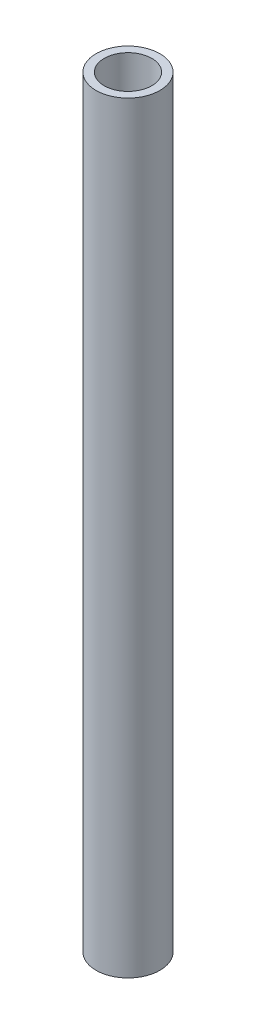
from build123d import *

# Parameters (mm, degrees)
SKETCH1_R           = 3.9878
SKETCH1_R_2         = 2.9718
BOSS_EXTRUDE1_DEPTH = 95.25


with BuildPart() as part:
    # Sketch1 → Boss-Extrude1 (new body)
    with BuildSketch(Plane(origin=(0, 0, 0), x_dir=(1, 0, 0), z_dir=(0, 1, 0))):
        with Locations(Location((0, 0, 0), (0, 0, 270))):
            Circle(SKETCH1_R)
        with Locations(Location((0, 0, 0), (0, 0, 270))):
            Circle(SKETCH1_R_2, mode=Mode.SUBTRACT)
    extrude(amount=BOSS_EXTRUDE1_DEPTH)


solid = part.part
